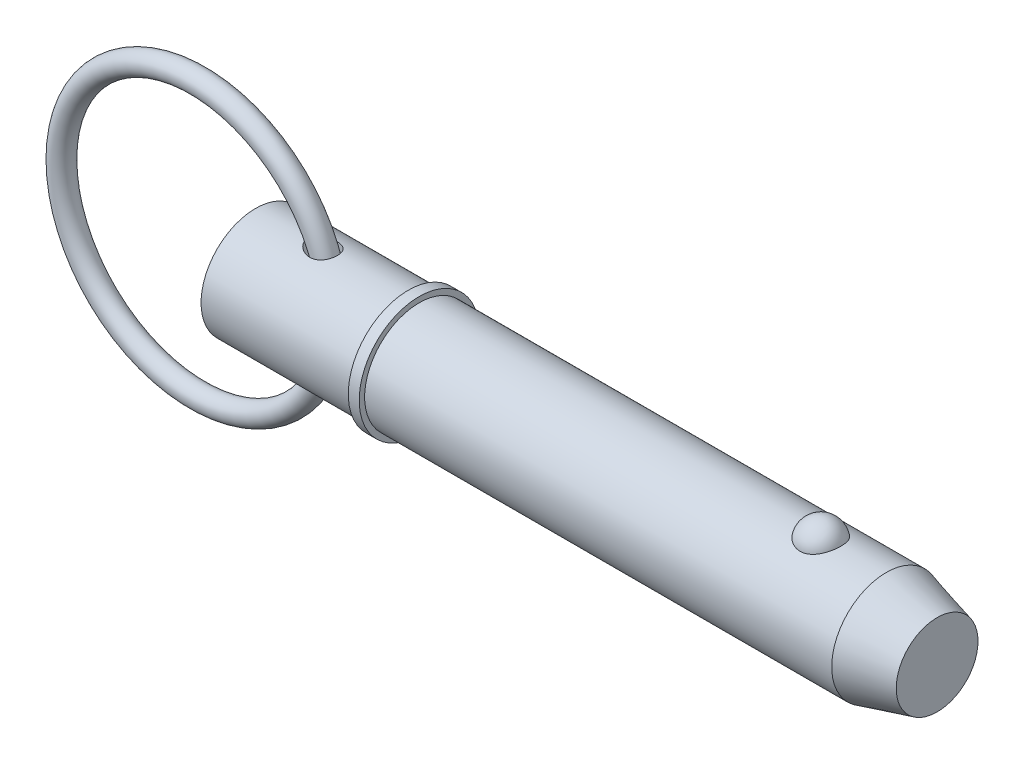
ISO-10303-21;
HEADER;
FILE_DESCRIPTION(('STEP AP214'),'2;1');
FILE_NAME('part.step','',(''),(''),'','','');
FILE_SCHEMA(('AUTOMOTIVE_DESIGN { 1 0 10303 214 1 1 1 1 }'));
ENDSEC;
DATA;
#1=APPLICATION_CONTEXT('core data for automotive mechanical design processes');
#2=APPLICATION_PROTOCOL_DEFINITION('international standard','automotive_design',2000,#1);
#3=PRODUCT_CONTEXT('',#1,'mechanical');
#4=PRODUCT('Part','Part','',(#3));
#5=PRODUCT_RELATED_PRODUCT_CATEGORY('part','',(#4));
#6=PRODUCT_DEFINITION_FORMATION('','',#4);
#7=PRODUCT_DEFINITION_CONTEXT('part definition',#1,'design');
#8=PRODUCT_DEFINITION('design','',#6,#7);
#9=PRODUCT_DEFINITION_SHAPE('','',#8);
#10=(LENGTH_UNIT() NAMED_UNIT(*) SI_UNIT(.MILLI.,.METRE.));
#11=(NAMED_UNIT(*) PLANE_ANGLE_UNIT() SI_UNIT($,.RADIAN.));
#12=(NAMED_UNIT(*) SI_UNIT($,.STERADIAN.) SOLID_ANGLE_UNIT());
#13=UNCERTAINTY_MEASURE_WITH_UNIT(LENGTH_MEASURE(1.E-05),#10,'distance_accuracy_value','');
#14=(GEOMETRIC_REPRESENTATION_CONTEXT(3) GLOBAL_UNCERTAINTY_ASSIGNED_CONTEXT((#13)) GLOBAL_UNIT_ASSIGNED_CONTEXT((#10,
#11,#12)) REPRESENTATION_CONTEXT('',''));
#15=CARTESIAN_POINT('',(0.,0.,0.));
#16=DIRECTION('',(0.,0.,1.));
#17=DIRECTION('',(1.,0.,0.));
#18=AXIS2_PLACEMENT_3D('',#15,#16,#17);
#19=CARTESIAN_POINT('',(-13.4840686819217,0.,0.));
#20=DIRECTION('',(0.,0.,1.));
#21=DIRECTION('',(1.,0.,0.));
#22=AXIS2_PLACEMENT_3D('',#19,#20,#21);
#23=TOROIDAL_SURFACE('',#22,31.75,2.54);
#24=CARTESIAN_POINT('',(20.8059313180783,0.,0.));
#25=VERTEX_POINT('',#24);
#26=VERTEX_LOOP('',#25);
#27=FACE_BOUND('',#26,.T.);
#28=ADVANCED_FACE('P0_F12',(#27),#23,.T.);
#29=CLOSED_SHELL('',(#28));
#30=MANIFOLD_SOLID_BREP('P0_B1',#29);
#31=CARTESIAN_POINT('',(0.,0.,0.));
#32=DIRECTION('',(1.,0.,0.));
#33=DIRECTION('',(0.,0.,-1.));
#34=AXIS2_PLACEMENT_3D('',#31,#32,#33);
#35=CYLINDRICAL_SURFACE('',#34,12.7);
#36=CARTESIAN_POINT('',(13.092900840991,12.5230976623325,-2.11234992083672));
#37=CARTESIAN_POINT('',(13.2535855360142,12.4976398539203,-2.26328363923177));
#38=CARTESIAN_POINT('',(13.4280602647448,12.4718592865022,-2.3995578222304));
#39=CARTESIAN_POINT('',(13.7976341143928,12.4229301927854,-2.64122157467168));
#40=CARTESIAN_POINT('',(13.9927568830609,12.3997847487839,-2.74657519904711));
#41=CARTESIAN_POINT('',(14.397672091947,12.3590534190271,-2.92439761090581));
#42=CARTESIAN_POINT('',(14.6074445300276,12.3414601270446,-2.99691026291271));
#43=CARTESIAN_POINT('',(15.0366557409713,12.3142893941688,-3.10669649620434));
#44=CARTESIAN_POINT('',(15.2560902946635,12.3047084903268,-3.14398530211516));
#45=CARTESIAN_POINT('',(15.5877843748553,12.2976819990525,-3.17128282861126));
#46=CARTESIAN_POINT('',(15.6989364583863,12.2965677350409,-3.17559470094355));
#47=CARTESIAN_POINT('',(15.9211629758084,12.2969101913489,-3.17427486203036));
#48=CARTESIAN_POINT('',(16.0322374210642,12.2983656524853,-3.16864802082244));
#49=CARTESIAN_POINT('',(16.2532861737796,12.3038832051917,-3.14715368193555));
#50=CARTESIAN_POINT('',(16.363260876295,12.3079443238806,-3.13129000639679));
#51=CARTESIAN_POINT('',(16.5810669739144,12.3185954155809,-3.08912320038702));
#52=CARTESIAN_POINT('',(16.6888986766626,12.3251850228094,-3.06282157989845));
#53=CARTESIAN_POINT('',(16.8894247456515,12.3398294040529,-3.00323791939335));
#54=CARTESIAN_POINT('',(16.9824664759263,12.3476389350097,-2.97106098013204));
#55=CARTESIAN_POINT('',(17.1651267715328,12.3648759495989,-2.89848824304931));
#56=CARTESIAN_POINT('',(17.2547457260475,12.3743032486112,-2.85809338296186));
#57=CARTESIAN_POINT('',(17.4297224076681,12.3944822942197,-2.76927391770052));
#58=CARTESIAN_POINT('',(17.5150817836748,12.40523352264,-2.72085245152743));
#59=CARTESIAN_POINT('',(17.6807665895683,12.4277046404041,-2.61629867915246));
#60=CARTESIAN_POINT('',(17.7610923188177,12.4394244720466,-2.56016683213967));
#61=CARTESIAN_POINT('',(17.9797287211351,12.4733252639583,-2.39133767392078));
#62=CARTESIAN_POINT('',(18.1114611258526,12.4961902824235,-2.27005507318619));
#63=CARTESIAN_POINT('',(18.3518677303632,12.5412050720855,-2.00648954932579));
#64=CARTESIAN_POINT('',(18.4605454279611,12.5633549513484,-1.86420981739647));
#65=CARTESIAN_POINT('',(18.6498843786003,12.6039384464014,-1.56614816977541));
#66=CARTESIAN_POINT('',(18.7311185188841,12.622444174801,-1.41073996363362));
#67=CARTESIAN_POINT('',(18.8669149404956,12.6543302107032,-1.08819514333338));
#68=CARTESIAN_POINT('',(18.921477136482,12.6677105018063,-0.921058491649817));
#69=CARTESIAN_POINT('',(19.0028875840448,12.6879542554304,-0.579029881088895));
#70=CARTESIAN_POINT('',(19.0296164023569,12.6947896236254,-0.404107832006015));
#71=CARTESIAN_POINT('',(19.0543673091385,12.7011128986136,-0.0521104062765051));
#72=CARTESIAN_POINT('',(19.0523885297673,12.7006005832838,0.124965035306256));
#73=CARTESIAN_POINT('',(19.019700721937,12.692266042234,0.476969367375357));
#74=CARTESIAN_POINT('',(18.9888798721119,12.6844153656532,0.651887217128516));
#75=CARTESIAN_POINT('',(18.8990221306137,12.6622099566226,0.99389064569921));
#76=CARTESIAN_POINT('',(18.839985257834,12.6478552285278,1.16097622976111));
#77=CARTESIAN_POINT('',(18.6951419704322,12.6142309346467,1.48231767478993));
#78=CARTESIAN_POINT('',(18.6093706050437,12.5949678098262,1.63659000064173));
#79=CARTESIAN_POINT('',(18.4131352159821,12.5536490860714,1.92810749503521));
#80=CARTESIAN_POINT('',(18.3026732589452,12.5315937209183,2.06535408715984));
#81=CARTESIAN_POINT('',(18.060669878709,12.4872833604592,2.31822774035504));
#82=CARTESIAN_POINT('',(17.9292520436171,12.4650302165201,2.43397343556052));
#83=CARTESIAN_POINT('',(17.6485957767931,12.4226514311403,2.64178289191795));
#84=CARTESIAN_POINT('',(17.4993587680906,12.4025256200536,2.73384854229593));
#85=CARTESIAN_POINT('',(17.1869531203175,12.3664726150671,2.8925825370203));
#86=CARTESIAN_POINT('',(17.0237450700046,12.3505578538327,2.95917592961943));
#87=CARTESIAN_POINT('',(16.6884731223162,12.3245177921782,3.06582547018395));
#88=CARTESIAN_POINT('',(16.516407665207,12.3143935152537,3.10587692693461));
#89=CARTESIAN_POINT('',(16.1604213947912,12.3003788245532,3.16093927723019));
#90=CARTESIAN_POINT('',(15.9763106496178,12.2967791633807,3.17478342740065));
#91=CARTESIAN_POINT('',(15.6080973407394,12.2966663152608,3.17521180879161));
#92=CARTESIAN_POINT('',(15.4239948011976,12.3001555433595,3.16178674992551));
#93=CARTESIAN_POINT('',(15.0417156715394,12.3141744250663,3.10676725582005));
#94=CARTESIAN_POINT('',(14.8439465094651,12.3253658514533,3.06251977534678));
#95=CARTESIAN_POINT('',(14.4574652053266,12.3538942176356,2.94531863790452));
#96=CARTESIAN_POINT('',(14.2687614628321,12.3712367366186,2.87233891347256));
#97=CARTESIAN_POINT('',(13.8856104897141,12.4121323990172,2.69045747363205));
#98=CARTESIAN_POINT('',(13.6926012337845,12.4361434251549,2.57861276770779));
#99=CARTESIAN_POINT('',(13.328588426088,12.4862632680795,2.32379935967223));
#100=CARTESIAN_POINT('',(13.1575718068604,12.5123708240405,2.18084927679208));
#101=CARTESIAN_POINT('',(12.8776146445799,12.5579467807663,1.89840233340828));
#102=CARTESIAN_POINT('',(12.7631663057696,12.5776642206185,1.76440341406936));
#103=CARTESIAN_POINT('',(12.5574911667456,12.6143643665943,1.47931295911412));
#104=CARTESIAN_POINT('',(12.4662309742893,12.6313509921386,1.32824646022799));
#105=CARTESIAN_POINT('',(12.3240650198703,12.6583901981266,1.03598403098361));
#106=CARTESIAN_POINT('',(12.2691183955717,12.6691064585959,0.896822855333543));
#107=CARTESIAN_POINT('',(12.1828741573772,12.6860954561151,0.611068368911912));
#108=CARTESIAN_POINT('',(12.1515620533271,12.6923709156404,0.464479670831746));
#109=CARTESIAN_POINT('',(12.1147168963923,12.6997676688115,0.167420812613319));
#110=CARTESIAN_POINT('',(12.1092708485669,12.7008715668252,0.0169392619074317));
#111=CARTESIAN_POINT('',(12.1248234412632,12.6977391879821,-0.282592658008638));
#112=CARTESIAN_POINT('',(12.1458245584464,12.6935024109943,-0.431642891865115));
#113=CARTESIAN_POINT('',(12.210908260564,12.6805581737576,-0.716008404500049));
#114=CARTESIAN_POINT('',(12.2537133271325,12.6720986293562,-0.851633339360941));
#115=CARTESIAN_POINT('',(12.3591295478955,12.6516826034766,-1.11460776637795));
#116=CARTESIAN_POINT('',(12.4217455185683,12.6397252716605,-1.24195523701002));
#117=CARTESIAN_POINT('',(12.5735635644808,12.61152213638,-1.50300095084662));
#118=CARTESIAN_POINT('',(12.6652159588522,12.5949150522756,-1.63522875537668));
#119=CARTESIAN_POINT('',(12.8664347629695,12.5599626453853,-1.88501670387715));
#120=CARTESIAN_POINT('',(12.9760196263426,12.541615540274,-2.0025615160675));
#121=CARTESIAN_POINT('',(13.092900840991,12.5230976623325,-2.11234992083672));
#122=B_SPLINE_CURVE_WITH_KNOTS('',3,(#36,#37,#38,#39,#40,#41,#42,#43,#44,#45,#46,#47,#48,#49,
#50,#51,#52,#53,#54,#55,#56,#57,#58,#59,#60,#61,#62,#63,#64,#65,#66,#67,#68,#69,#70,#71,#72,#73,
#74,#75,#76,#77,#78,#79,#80,#81,#82,#83,#84,#85,#86,#87,#88,#89,#90,#91,#92,#93,#94,#95,#96,#97,
#98,#99,#100,#101,#102,#103,#104,#105,#106,#107,#108,#109,#110,#111,#112,#113,#114,#115,#116,
#117,#118,#119,#120,#121),.UNSPECIFIED.,.T.,.F.,(4,2,2,2,2,2,2,2,2,2,2,2,2,2,2,2,2,2,2,2,2,2,2,
2,2,2,2,2,2,2,2,2,2,2,2,2,2,2,2,2,2,2,4),(0.,0.665132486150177,1.33103515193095,
1.99604575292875,2.66076878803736,2.99410229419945,3.32727250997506,3.66031840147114,
3.99331613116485,4.28918991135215,4.58502994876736,4.88075456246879,5.17646157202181,
5.71510826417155,6.2536731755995,6.78017774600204,7.30668400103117,7.83544030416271,
8.36421259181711,8.89504347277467,9.42587399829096,9.95601150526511,10.4861046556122,
11.0131799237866,11.5402131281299,12.0687854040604,12.5974510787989,13.1491450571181,
13.7010270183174,14.3074556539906,14.914435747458,15.5844380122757,16.2540403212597,
16.7839879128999,17.3131679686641,17.7612578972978,18.2090728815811,18.658393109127,
19.1077554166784,19.5333866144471,19.959121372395,20.4424347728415,20.9262486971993),.UNSPECIFIED.);
#123=CARTESIAN_POINT('',(13.092900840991,12.5230976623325,-2.11234992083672));
#124=VERTEX_POINT('',#123);
#125=EDGE_CURVE('P1_E42',#124,#124,#122,.T.);
#126=ORIENTED_EDGE('',*,*,#125,.T.);
#127=EDGE_LOOP('',(#126));
#128=FACE_BOUND('',#127,.T.);
#129=CARTESIAN_POINT('',(0.,0.,0.));
#130=DIRECTION('',(1.,0.,0.));
#131=DIRECTION('',(0.,0.,-1.));
#132=AXIS2_PLACEMENT_3D('',#129,#130,#131);
#133=CIRCLE('',#132,12.7);
#134=CARTESIAN_POINT('',(0.,0.,-12.7));
#135=VERTEX_POINT('',#134);
#136=EDGE_CURVE('P1_E9',#135,#135,#133,.T.);
#137=ORIENTED_EDGE('',*,*,#136,.T.);
#138=EDGE_LOOP('',(#137));
#139=FACE_BOUND('',#138,.T.);
#140=CARTESIAN_POINT('',(35.56,0.,0.));
#141=DIRECTION('',(1.,0.,0.));
#142=DIRECTION('',(0.,0.,-1.));
#143=AXIS2_PLACEMENT_3D('',#140,#141,#142);
#144=CIRCLE('',#143,12.7);
#145=CARTESIAN_POINT('',(35.56,0.,-12.7));
#146=VERTEX_POINT('',#145);
#147=EDGE_CURVE('P1_E25',#146,#146,#144,.T.);
#148=ORIENTED_EDGE('',*,*,#147,.F.);
#149=EDGE_LOOP('',(#148));
#150=FACE_BOUND('',#149,.T.);
#151=CARTESIAN_POINT('',(13.092900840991,-12.5230976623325,-2.11234992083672));
#152=CARTESIAN_POINT('',(12.9659872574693,-12.5432050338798,-1.99314161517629));
#153=CARTESIAN_POINT('',(12.847667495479,-12.5631124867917,-1.86478966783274));
#154=CARTESIAN_POINT('',(12.6324721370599,-12.6007427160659,-1.59069749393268));
#155=CARTESIAN_POINT('',(12.5355833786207,-12.6184668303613,-1.444968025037));
#156=CARTESIAN_POINT('',(12.409907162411,-12.642034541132,-1.21450950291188));
#157=CARTESIAN_POINT('',(12.3711427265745,-12.6494175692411,-1.13527163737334));
#158=CARTESIAN_POINT('',(12.3010994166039,-12.6628962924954,-0.973464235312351));
#159=CARTESIAN_POINT('',(12.2698164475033,-12.6689926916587,-0.890896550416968));
#160=CARTESIAN_POINT('',(12.2153933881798,-12.6796767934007,-0.723090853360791));
#161=CARTESIAN_POINT('',(12.192246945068,-12.6842656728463,-0.637854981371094));
#162=CARTESIAN_POINT('',(12.154603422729,-12.6917620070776,-0.465421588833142));
#163=CARTESIAN_POINT('',(12.1401047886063,-12.69466976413,-0.378224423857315));
#164=CARTESIAN_POINT('',(12.1214471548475,-12.6984180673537,-0.214417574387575));
#165=CARTESIAN_POINT('',(12.1161713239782,-12.699481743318,-0.137938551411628));
#166=CARTESIAN_POINT('',(12.1124989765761,-12.7002217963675,0.0152189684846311));
#167=CARTESIAN_POINT('',(12.1141046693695,-12.6998977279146,0.0918975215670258));
#168=CARTESIAN_POINT('',(12.1241695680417,-12.6978712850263,0.24474645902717));
#169=CARTESIAN_POINT('',(12.132625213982,-12.6961696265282,0.320917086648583));
#170=CARTESIAN_POINT('',(12.1562110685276,-12.6914452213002,0.472185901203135));
#171=CARTESIAN_POINT('',(12.1713438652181,-12.6884219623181,0.547283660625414));
#172=CARTESIAN_POINT('',(12.223731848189,-12.6780227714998,0.759415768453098));
#173=CARTESIAN_POINT('',(12.268839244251,-12.6691353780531,0.894507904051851));
#174=CARTESIAN_POINT('',(12.3786059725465,-12.6479567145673,1.1560647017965));
#175=CARTESIAN_POINT('',(12.4432700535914,-12.6356646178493,1.28252725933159));
#176=CARTESIAN_POINT('',(12.5971341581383,-12.607236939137,1.5381272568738));
#177=CARTESIAN_POINT('',(12.6882234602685,-12.5908303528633,1.66609325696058));
#178=CARTESIAN_POINT('',(12.887209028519,-12.5564642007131,1.90792082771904));
#179=CARTESIAN_POINT('',(12.995115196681,-12.5385037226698,2.02177401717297));
#180=CARTESIAN_POINT('',(13.2471335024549,-12.4987806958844,2.25547266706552));
#181=CARTESIAN_POINT('',(13.3941979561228,-12.4769622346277,2.3721269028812));
#182=CARTESIAN_POINT('',(13.7036983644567,-12.4349587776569,2.58329351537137));
#183=CARTESIAN_POINT('',(13.8661464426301,-12.4147750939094,2.67778822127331));
#184=CARTESIAN_POINT('',(14.2306024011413,-12.3748157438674,2.85722657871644));
#185=CARTESIAN_POINT('',(14.4347220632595,-12.3556533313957,2.93804226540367));
#186=CARTESIAN_POINT('',(14.8540416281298,-12.3245430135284,3.06594877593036));
#187=CARTESIAN_POINT('',(15.0692453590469,-12.3125976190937,3.11302786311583));
#188=CARTESIAN_POINT('',(15.3981213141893,-12.3014943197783,3.15648626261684));
#189=CARTESIAN_POINT('',(15.5100235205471,-12.298940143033,3.16639841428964));
#190=CARTESIAN_POINT('',(15.7342812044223,-12.2963942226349,3.17627668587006));
#191=CARTESIAN_POINT('',(15.8466364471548,-12.2964012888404,3.1762474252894));
#192=CARTESIAN_POINT('',(16.0707903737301,-12.2990694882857,3.16589868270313));
#193=CARTESIAN_POINT('',(16.1825892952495,-12.3017293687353,3.1555840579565));
#194=CARTESIAN_POINT('',(16.4046123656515,-12.3096862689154,3.12440163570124));
#195=CARTESIAN_POINT('',(16.514836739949,-12.314982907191,3.10353536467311));
#196=CARTESIAN_POINT('',(16.7211934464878,-12.3273933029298,3.05384263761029));
#197=CARTESIAN_POINT('',(16.8175961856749,-12.3342598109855,3.0260738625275));
#198=CARTESIAN_POINT('',(17.0073515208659,-12.3498131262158,2.96195947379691));
#199=CARTESIAN_POINT('',(17.100704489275,-12.3584997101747,2.92561491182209));
#200=CARTESIAN_POINT('',(17.2834584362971,-12.3774243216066,2.84448580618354));
#201=CARTESIAN_POINT('',(17.3728610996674,-12.3876616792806,2.79970490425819));
#202=CARTESIAN_POINT('',(17.5469061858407,-12.409352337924,2.701939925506));
#203=CARTESIAN_POINT('',(17.6315489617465,-12.4208055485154,2.64895645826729));
#204=CARTESIAN_POINT('',(17.7872886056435,-12.4433734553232,2.54070972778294));
#205=CARTESIAN_POINT('',(17.8589017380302,-12.4544123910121,2.48617167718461));
#206=CARTESIAN_POINT('',(17.9970802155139,-12.4768404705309,2.37105291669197));
#207=CARTESIAN_POINT('',(18.063643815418,-12.4882297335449,2.31047013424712));
#208=CARTESIAN_POINT('',(18.1911677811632,-12.5110137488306,2.18372894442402));
#209=CARTESIAN_POINT('',(18.2521311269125,-12.5224084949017,2.11757353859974));
#210=CARTESIAN_POINT('',(18.3680676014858,-12.5448751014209,1.98014449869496));
#211=CARTESIAN_POINT('',(18.4230385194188,-12.5559468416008,1.90886899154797));
#212=CARTESIAN_POINT('',(18.5752306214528,-12.5875288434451,1.69257698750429));
#213=CARTESIAN_POINT('',(18.6637018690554,-12.6071482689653,1.54111740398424));
#214=CARTESIAN_POINT('',(18.8143485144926,-12.6417556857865,1.225260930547));
#215=CARTESIAN_POINT('',(18.876524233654,-12.6567437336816,1.06086419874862));
#216=CARTESIAN_POINT('',(18.9733884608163,-12.6805238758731,0.723195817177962));
#217=CARTESIAN_POINT('',(19.0079967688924,-12.6892978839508,0.549899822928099));
#218=CARTESIAN_POINT('',(19.0486500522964,-12.6996362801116,0.199781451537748));
#219=CARTESIAN_POINT('',(19.054694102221,-12.7012004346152,0.0229589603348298));
#220=CARTESIAN_POINT('',(19.0380549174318,-12.6969431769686,-0.330044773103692));
#221=CARTESIAN_POINT('',(19.0152419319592,-12.6910884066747,-0.506219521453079));
#222=CARTESIAN_POINT('',(18.9411599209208,-12.672565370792,-0.852112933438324));
#223=CARTESIAN_POINT('',(18.8898907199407,-12.659897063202,-1.0218315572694));
#224=CARTESIAN_POINT('',(18.7600888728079,-12.6291327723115,-1.34987035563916));
#225=CARTESIAN_POINT('',(18.6815715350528,-12.6110398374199,-1.50819687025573));
#226=CARTESIAN_POINT('',(18.4991526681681,-12.5714188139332,-1.808997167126));
#227=CARTESIAN_POINT('',(18.3952529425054,-12.5498909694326,-1.95147207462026));
#228=CARTESIAN_POINT('',(18.1653806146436,-12.5059234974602,-2.21580059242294));
#229=CARTESIAN_POINT('',(18.0395297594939,-12.4834893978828,-2.33776101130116));
#230=CARTESIAN_POINT('',(17.7688701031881,-12.4400863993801,-2.55870399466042));
#231=CARTESIAN_POINT('',(17.6240631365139,-12.4191173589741,-2.65768878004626));
#232=CARTESIAN_POINT('',(17.3196803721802,-12.380896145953,-2.8304192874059));
#233=CARTESIAN_POINT('',(17.1601036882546,-12.3636441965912,-2.90416349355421));
#234=CARTESIAN_POINT('',(16.8308162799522,-12.3345597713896,-3.02531546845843));
#235=CARTESIAN_POINT('',(16.6611041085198,-12.322728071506,-3.07271946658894));
#236=CARTESIAN_POINT('',(16.3099674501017,-12.3051318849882,-3.14246490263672));
#237=CARTESIAN_POINT('',(16.1283412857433,-12.2996014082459,-3.16384159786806));
#238=CARTESIAN_POINT('',(15.7639014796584,-12.2955807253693,-3.17942379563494));
#239=CARTESIAN_POINT('',(15.5810875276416,-12.2970924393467,-3.17362188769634));
#240=CARTESIAN_POINT('',(15.20154276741,-12.307074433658,-3.13470416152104));
#241=CARTESIAN_POINT('',(15.0050835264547,-12.316173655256,-3.09911848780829));
#242=CARTESIAN_POINT('',(14.6197996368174,-12.3407987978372,-2.99954607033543));
#243=CARTESIAN_POINT('',(14.4309834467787,-12.3563316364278,-2.93552875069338));
#244=CARTESIAN_POINT('',(14.0353751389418,-12.3949378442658,-2.76840280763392));
#245=CARTESIAN_POINT('',(13.8306109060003,-12.4188242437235,-2.66064798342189));
#246=CARTESIAN_POINT('',(13.4432099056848,-12.4696241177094,-2.4113475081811));
#247=CARTESIAN_POINT('',(13.2605568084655,-12.4965353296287,-2.26982702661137));
#248=CARTESIAN_POINT('',(13.092900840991,-12.5230976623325,-2.11234992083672));
#249=B_SPLINE_CURVE_WITH_KNOTS('',3,(#151,#152,#153,#154,#155,#156,#157,#158,#159,#160,#161,
#162,#163,#164,#165,#166,#167,#168,#169,#170,#171,#172,#173,#174,#175,#176,#177,#178,#179,#180,
#181,#182,#183,#184,#185,#186,#187,#188,#189,#190,#191,#192,#193,#194,#195,#196,#197,#198,#199,
#200,#201,#202,#203,#204,#205,#206,#207,#208,#209,#210,#211,#212,#213,#214,#215,#216,#217,#218,
#219,#220,#221,#222,#223,#224,#225,#226,#227,#228,#229,#230,#231,#232,#233,#234,#235,#236,#237,
#238,#239,#240,#241,#242,#243,#244,#245,#246,#247,#248),.UNSPECIFIED.,.T.,.F.,(4,2,2,2,2,2,2,2,
2,2,2,2,2,2,2,2,2,2,2,2,2,2,2,2,2,2,2,2,2,2,2,2,2,2,2,2,2,2,2,2,2,2,2,2,2,2,2,2,4),(0.,
0.525289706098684,1.05025590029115,1.31549608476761,1.58059075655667,1.84547798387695,
2.11031756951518,2.34000998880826,2.56977615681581,2.79942299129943,3.0291589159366,
3.45531787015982,3.8815803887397,4.35362362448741,4.82594586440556,5.39074449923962,
5.95599200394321,6.61421946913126,7.27267581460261,7.60939383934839,7.9459554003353,
8.2823580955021,8.61871213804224,8.91997243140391,9.22119579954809,9.52228943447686,
9.82336070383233,10.0950952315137,10.3669232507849,10.6386057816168,10.9103882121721,
11.4371688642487,11.9639430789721,12.4922442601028,13.0205625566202,13.5512648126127,
14.0819703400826,14.6123781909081,15.1427483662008,15.6702654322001,16.1977314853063,
16.7252292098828,17.2528024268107,17.7993878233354,18.3461222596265,18.9432829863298,
19.541087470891,20.2355241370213,20.9294447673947),.UNSPECIFIED.);
#250=CARTESIAN_POINT('',(13.092900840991,-12.5230976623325,-2.11234992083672));
#251=VERTEX_POINT('',#250);
#252=EDGE_CURVE('P1_E17',#251,#251,#249,.T.);
#253=ORIENTED_EDGE('',*,*,#252,.T.);
#254=EDGE_LOOP('',(#253));
#255=FACE_BOUND('',#254,.T.);
#256=ADVANCED_FACE('P1_F13',(#128,#139,#150,#255),#35,.T.);
#257=CARTESIAN_POINT('',(0.,0.,0.));
#258=DIRECTION('',(1.,0.,0.));
#259=DIRECTION('',(0.,0.,-1.));
#260=AXIS2_PLACEMENT_3D('',#257,#258,#259);
#261=CYLINDRICAL_SURFACE('',#260,12.7);
#262=CARTESIAN_POINT('',(146.900738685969,0.,0.));
#263=DIRECTION('',(1.,0.,0.));
#264=DIRECTION('',(0.,0.,-1.));
#265=AXIS2_PLACEMENT_3D('',#262,#263,#264);
#266=CIRCLE('',#265,12.7);
#267=CARTESIAN_POINT('',(146.900738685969,0.,-12.7));
#268=VERTEX_POINT('',#267);
#269=EDGE_CURVE('P1_E99',#268,#268,#266,.T.);
#270=ORIENTED_EDGE('',*,*,#269,.F.);
#271=EDGE_LOOP('',(#270));
#272=FACE_BOUND('',#271,.T.);
#273=CARTESIAN_POINT('',(38.1,0.,0.));
#274=DIRECTION('',(1.,0.,0.));
#275=DIRECTION('',(0.,0.,-1.));
#276=AXIS2_PLACEMENT_3D('',#273,#274,#275);
#277=CIRCLE('',#276,12.7);
#278=CARTESIAN_POINT('',(38.1,0.,-12.7));
#279=VERTEX_POINT('',#278);
#280=EDGE_CURVE('P1_E96',#279,#279,#277,.T.);
#281=ORIENTED_EDGE('',*,*,#280,.T.);
#282=EDGE_LOOP('',(#281));
#283=FACE_BOUND('',#282,.T.);
#284=CARTESIAN_POINT('',(131.660042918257,11.7500437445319,4.81938502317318));
#285=CARTESIAN_POINT('',(131.535088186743,11.7500430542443,4.81938571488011));
#286=CARTESIAN_POINT('',(131.410144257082,11.7520975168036,4.81438658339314));
#287=CARTESIAN_POINT('',(131.161142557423,11.760253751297,4.79442904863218));
#288=CARTESIAN_POINT('',(131.037085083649,11.7663568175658,4.77946746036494));
#289=CARTESIAN_POINT('',(130.790901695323,11.7824262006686,4.7397141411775));
#290=CARTESIAN_POINT('',(130.668774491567,11.7923898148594,4.71492928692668));
#291=CARTESIAN_POINT('',(130.427187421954,11.8158938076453,4.65571340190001));
#292=CARTESIAN_POINT('',(130.30772859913,11.8294355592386,4.6212786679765));
#293=CARTESIAN_POINT('',(130.072557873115,11.8596812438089,4.54309502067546));
#294=CARTESIAN_POINT('',(129.956839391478,11.8763792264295,4.49936361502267));
#295=CARTESIAN_POINT('',(129.729653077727,11.9124878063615,4.40287235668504));
#296=CARTESIAN_POINT('',(129.618186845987,11.9318994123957,4.35010914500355));
#297=CARTESIAN_POINT('',(129.291278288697,11.9934256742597,4.17881316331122));
#298=CARTESIAN_POINT('',(129.083127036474,12.038858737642,4.04720756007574));
#299=CARTESIAN_POINT('',(128.685850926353,12.1352173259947,3.748564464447));
#300=CARTESIAN_POINT('',(128.497443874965,12.1862630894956,3.58061821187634));
#301=CARTESIAN_POINT('',(128.150521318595,12.2875163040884,3.21600758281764));
#302=CARTESIAN_POINT('',(127.992011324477,12.3377235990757,3.0193379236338));
#303=CARTESIAN_POINT('',(127.70168878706,12.4344923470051,2.592916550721));
#304=CARTESIAN_POINT('',(127.571376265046,12.4807925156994,2.36208286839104));
#305=CARTESIAN_POINT('',(127.349407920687,12.5623454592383,1.88070399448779));
#306=CARTESIAN_POINT('',(127.257755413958,12.5975972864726,1.63015711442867));
#307=CARTESIAN_POINT('',(127.114046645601,12.6538414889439,1.1129886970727));
#308=CARTESIAN_POINT('',(127.062499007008,12.6746503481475,0.846205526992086));
#309=CARTESIAN_POINT('',(127.001977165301,12.699153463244,0.307085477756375));
#310=CARTESIAN_POINT('',(126.993001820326,12.7028481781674,0.034748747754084));
#311=CARTESIAN_POINT('',(127.017731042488,12.6927785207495,-0.506073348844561));
#312=CARTESIAN_POINT('',(127.051189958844,12.6791146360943,-0.774571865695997));
#313=CARTESIAN_POINT('',(127.159687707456,12.635882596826,-1.30170246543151));
#314=CARTESIAN_POINT('',(127.23472729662,12.606314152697,-1.56033436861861));
#315=CARTESIAN_POINT('',(127.425000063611,12.5342328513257,-2.0608389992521));
#316=CARTESIAN_POINT('',(127.540287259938,12.4917026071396,-2.30268867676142));
#317=CARTESIAN_POINT('',(127.808704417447,12.3981123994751,-2.76259600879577));
#318=CARTESIAN_POINT('',(127.961837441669,12.3470517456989,-2.98065173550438));
#319=CARTESIAN_POINT('',(128.303507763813,12.2416045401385,-3.38786328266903));
#320=CARTESIAN_POINT('',(128.492201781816,12.1872040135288,-3.57688418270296));
#321=CARTESIAN_POINT('',(128.900239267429,12.0814086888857,-3.91941073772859));
#322=CARTESIAN_POINT('',(129.119580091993,12.0300136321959,-4.07291945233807));
#323=CARTESIAN_POINT('',(129.578375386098,11.9373542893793,-4.33691289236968));
#324=CARTESIAN_POINT('',(129.817304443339,11.8958982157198,-4.44824125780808));
#325=CARTESIAN_POINT('',(130.31243761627,11.8268116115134,-4.62881985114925));
#326=CARTESIAN_POINT('',(130.568635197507,11.7991758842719,-4.69808589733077));
#327=CARTESIAN_POINT('',(131.077164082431,11.7622209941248,-4.78983181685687));
#328=CARTESIAN_POINT('',(131.329041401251,11.7520502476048,-4.81449025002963));
#329=CARTESIAN_POINT('',(131.833573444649,11.7485796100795,-4.82295735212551));
#330=CARTESIAN_POINT('',(132.086228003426,11.7552763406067,-4.80677420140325));
#331=CARTESIAN_POINT('',(132.576834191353,11.7842584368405,-4.73525430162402));
#332=CARTESIAN_POINT('',(132.814998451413,11.8060486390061,-4.68116061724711));
#333=CARTESIAN_POINT('',(133.278489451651,11.8622750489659,-4.53678133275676));
#334=CARTESIAN_POINT('',(133.503815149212,11.8967122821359,-4.44649279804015));
#335=CARTESIAN_POINT('',(133.940801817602,11.9754603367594,-4.2298761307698));
#336=CARTESIAN_POINT('',(134.152057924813,12.0199699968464,-4.10280539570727));
#337=CARTESIAN_POINT('',(134.550601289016,12.1138028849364,-3.81685409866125));
#338=CARTESIAN_POINT('',(134.737883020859,12.163127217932,-3.65796622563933));
#339=CARTESIAN_POINT('',(135.093350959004,12.2642343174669,-3.30364864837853));
#340=CARTESIAN_POINT('',(135.260111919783,12.3160165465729,-3.10678783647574));
#341=CARTESIAN_POINT('',(135.559579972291,12.4142566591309,-2.68748409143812));
#342=CARTESIAN_POINT('',(135.692280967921,12.4607135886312,-2.4650365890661));
#343=CARTESIAN_POINT('',(135.924691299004,12.5450236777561,-1.9928951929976));
#344=CARTESIAN_POINT('',(136.023215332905,12.5825557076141,-1.74255918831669));
#345=CARTESIAN_POINT('',(136.179227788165,12.6431720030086,-1.22773734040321));
#346=CARTESIAN_POINT('',(136.236715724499,12.6662560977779,-0.963251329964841));
#347=CARTESIAN_POINT('',(136.309544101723,12.6956486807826,-0.4273550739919));
#348=CARTESIAN_POINT('',(136.324837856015,12.7019385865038,-0.155937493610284));
#349=CARTESIAN_POINT('',(136.312779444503,12.6970201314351,0.38592890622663));
#350=CARTESIAN_POINT('',(136.28542805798,12.6858120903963,0.65637774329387));
#351=CARTESIAN_POINT('',(136.213060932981,12.6568455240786,1.05454017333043));
#352=CARTESIAN_POINT('',(136.183796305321,12.6451962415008,1.18577850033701));
#353=CARTESIAN_POINT('',(136.115022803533,12.6181819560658,1.44513808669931));
#354=CARTESIAN_POINT('',(136.075517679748,12.6028183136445,1.57326046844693));
#355=CARTESIAN_POINT('',(135.986439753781,12.5687547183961,1.82554978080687));
#356=CARTESIAN_POINT('',(135.936862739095,12.5500533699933,1.94971503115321));
#357=CARTESIAN_POINT('',(135.82792115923,12.5098093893,2.19314370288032));
#358=CARTESIAN_POINT('',(135.768560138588,12.4882677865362,2.31240887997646));
#359=CARTESIAN_POINT('',(135.63997128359,12.4427679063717,2.5459303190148));
#360=CARTESIAN_POINT('',(135.570688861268,12.4187964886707,2.66015396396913));
#361=CARTESIAN_POINT('',(135.422903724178,12.3691892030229,2.88202659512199));
#362=CARTESIAN_POINT('',(135.344404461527,12.3435539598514,2.98967802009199));
#363=CARTESIAN_POINT('',(135.178550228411,12.2912955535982,3.1977438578));
#364=CARTESIAN_POINT('',(135.091191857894,12.2646720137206,3.29815546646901));
#365=CARTESIAN_POINT('',(134.908161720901,12.2111945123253,3.49095035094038));
#366=CARTESIAN_POINT('',(134.812493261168,12.1843406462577,3.58333679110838));
#367=CARTESIAN_POINT('',(134.613627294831,12.1312249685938,3.75922876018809));
#368=CARTESIAN_POINT('',(134.510450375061,12.104961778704,3.84275713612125));
#369=CARTESIAN_POINT('',(134.29701336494,12.0537284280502,4.00056406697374));
#370=CARTESIAN_POINT('',(134.186756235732,12.028757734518,4.07484645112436));
#371=CARTESIAN_POINT('',(133.959755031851,11.9808306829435,4.21367959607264));
#372=CARTESIAN_POINT('',(133.843006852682,11.9578756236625,4.27822410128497));
#373=CARTESIAN_POINT('',(133.60394258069,11.9147184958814,4.39698483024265));
#374=CARTESIAN_POINT('',(133.481628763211,11.894515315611,4.45120522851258));
#375=CARTESIAN_POINT('',(133.222952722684,11.8561129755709,4.55255353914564));
#376=CARTESIAN_POINT('',(133.086223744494,11.8381764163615,4.59884858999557));
#377=CARTESIAN_POINT('',(132.808608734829,11.8069093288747,4.67853897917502));
#378=CARTESIAN_POINT('',(132.667724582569,11.7935767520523,4.71194005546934));
#379=CARTESIAN_POINT('',(132.38309446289,11.7720277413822,4.76552188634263));
#380=CARTESIAN_POINT('',(132.239348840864,11.7638106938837,4.78570422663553));
#381=CARTESIAN_POINT('',(131.950411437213,11.7528195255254,4.81263433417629));
#382=CARTESIAN_POINT('',(131.805219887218,11.7500445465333,4.81938421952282));
#383=CARTESIAN_POINT('',(131.660042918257,11.7500437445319,4.81938502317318));
#384=B_SPLINE_CURVE_WITH_KNOTS('',3,(#284,#285,#286,#287,#288,#289,#290,#291,#292,#293,#294,
#295,#296,#297,#298,#299,#300,#301,#302,#303,#304,#305,#306,#307,#308,#309,#310,#311,#312,#313,
#314,#315,#316,#317,#318,#319,#320,#321,#322,#323,#324,#325,#326,#327,#328,#329,#330,#331,#332,
#333,#334,#335,#336,#337,#338,#339,#340,#341,#342,#343,#344,#345,#346,#347,#348,#349,#350,#351,
#352,#353,#354,#355,#356,#357,#358,#359,#360,#361,#362,#363,#364,#365,#366,#367,#368,#369,#370,
#371,#372,#373,#374,#375,#376,#377,#378,#379,#380,#381,#382,#383),.UNSPECIFIED.,.T.,.F.,(4,2,2,
2,2,2,2,2,2,2,2,2,2,2,2,2,2,2,2,2,2,2,2,2,2,2,2,2,2,2,2,2,2,2,2,2,2,2,2,2,2,2,2,2,2,2,2,2,2,4),
(0.,0.374729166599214,0.749578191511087,1.12416526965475,1.49889629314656,1.87292776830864,
2.24709865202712,2.99481328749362,3.76399449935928,4.53331735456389,5.3368391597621,
6.14042986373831,6.95405296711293,7.76765424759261,8.57656703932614,9.38549455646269,
10.1955119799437,11.0055949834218,11.8193353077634,12.6330054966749,13.4294141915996,
14.2255231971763,14.9815786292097,15.7374826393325,16.4696948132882,17.2019663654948,
17.9501979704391,18.6986017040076,19.4844704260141,20.2704797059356,21.0815215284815,
21.8925729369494,22.7045213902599,23.5164550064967,23.9209608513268,24.3253187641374,
24.7298461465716,25.1342272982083,25.54092555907,25.9474719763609,26.3541750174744,
26.7607169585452,27.1661834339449,27.5714814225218,27.9770386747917,28.3824315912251,
28.818120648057,29.2536155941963,29.6890582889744,30.1244323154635),.UNSPECIFIED.);
#385=CARTESIAN_POINT('',(131.660042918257,11.7500437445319,4.81938502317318));
#386=VERTEX_POINT('',#385);
#387=EDGE_CURVE('P1_E34',#386,#386,#384,.T.);
#388=ORIENTED_EDGE('',*,*,#387,.T.);
#389=EDGE_LOOP('',(#388));
#390=FACE_BOUND('',#389,.T.);
#391=ADVANCED_FACE('P1_F46',(#272,#283,#390),#261,.T.);
#392=CARTESIAN_POINT('',(0.,0.,0.));
#393=DIRECTION('',(-1.,0.,0.));
#394=DIRECTION('',(0.,0.,1.));
#395=AXIS2_PLACEMENT_3D('',#392,#393,#394);
#396=PLANE('',#395);
#397=ORIENTED_EDGE('',*,*,#136,.F.);
#398=EDGE_LOOP('',(#397));
#399=FACE_BOUND('',#398,.T.);
#400=ADVANCED_FACE('P1_F15',(#399),#396,.T.);
#401=CARTESIAN_POINT('',(35.56,12.7,0.));
#402=DIRECTION('',(-1.,0.,0.));
#403=DIRECTION('',(0.,0.,1.));
#404=AXIS2_PLACEMENT_3D('',#401,#402,#403);
#405=PLANE('',#404);
#406=ORIENTED_EDGE('',*,*,#147,.T.);
#407=EDGE_LOOP('',(#406));
#408=FACE_BOUND('',#407,.T.);
#409=CARTESIAN_POINT('',(35.56,0.,0.));
#410=DIRECTION('',(1.,0.,0.));
#411=DIRECTION('',(0.,0.,-1.));
#412=AXIS2_PLACEMENT_3D('',#409,#410,#411);
#413=CIRCLE('',#412,13.97);
#414=CARTESIAN_POINT('',(35.56,0.,-13.97));
#415=VERTEX_POINT('',#414);
#416=EDGE_CURVE('P1_E30',#415,#415,#413,.T.);
#417=ORIENTED_EDGE('',*,*,#416,.F.);
#418=EDGE_LOOP('',(#417));
#419=FACE_BOUND('',#418,.T.);
#420=ADVANCED_FACE('P1_F81',(#408,#419),#405,.T.);
#421=CARTESIAN_POINT('',(0.,0.,0.));
#422=DIRECTION('',(1.,0.,0.));
#423=DIRECTION('',(0.,0.,-1.));
#424=AXIS2_PLACEMENT_3D('',#421,#422,#423);
#425=CYLINDRICAL_SURFACE('',#424,13.97);
#426=ORIENTED_EDGE('',*,*,#416,.T.);
#427=EDGE_LOOP('',(#426));
#428=FACE_BOUND('',#427,.T.);
#429=CARTESIAN_POINT('',(38.1,0.,0.));
#430=DIRECTION('',(1.,0.,0.));
#431=DIRECTION('',(0.,0.,-1.));
#432=AXIS2_PLACEMENT_3D('',#429,#430,#431);
#433=CIRCLE('',#432,13.97);
#434=CARTESIAN_POINT('',(38.1,0.,-13.97));
#435=VERTEX_POINT('',#434);
#436=EDGE_CURVE('P1_E95',#435,#435,#433,.T.);
#437=ORIENTED_EDGE('',*,*,#436,.F.);
#438=EDGE_LOOP('',(#437));
#439=FACE_BOUND('',#438,.T.);
#440=ADVANCED_FACE('P1_F68',(#428,#439),#425,.T.);
#441=CARTESIAN_POINT('',(38.1,13.97,0.));
#442=DIRECTION('',(1.,0.,0.));
#443=DIRECTION('',(0.,0.,-1.));
#444=AXIS2_PLACEMENT_3D('',#441,#442,#443);
#445=PLANE('',#444);
#446=ORIENTED_EDGE('',*,*,#436,.T.);
#447=EDGE_LOOP('',(#446));
#448=FACE_BOUND('',#447,.T.);
#449=ORIENTED_EDGE('',*,*,#280,.F.);
#450=EDGE_LOOP('',(#449));
#451=FACE_BOUND('',#450,.T.);
#452=ADVANCED_FACE('P1_F62',(#448,#451),#445,.T.);
#453=CARTESIAN_POINT('',(158.75,0.,0.));
#454=DIRECTION('',(-1.,0.,0.));
#455=DIRECTION('',(0.,0.,1.));
#456=AXIS2_PLACEMENT_3D('',#453,#454,#455);
#457=CONICAL_SURFACE('',#456,9.52500000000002,0.26179938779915);
#458=ORIENTED_EDGE('',*,*,#269,.T.);
#459=EDGE_LOOP('',(#458));
#460=FACE_BOUND('',#459,.T.);
#461=CARTESIAN_POINT('',(158.75,0.,0.));
#462=DIRECTION('',(1.,0.,0.));
#463=DIRECTION('',(0.,0.,-1.));
#464=AXIS2_PLACEMENT_3D('',#461,#462,#463);
#465=CIRCLE('',#464,9.52500000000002);
#466=CARTESIAN_POINT('',(158.75,0.,-9.52500000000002));
#467=VERTEX_POINT('',#466);
#468=EDGE_CURVE('P1_E41',#467,#467,#465,.T.);
#469=ORIENTED_EDGE('',*,*,#468,.F.);
#470=EDGE_LOOP('',(#469));
#471=FACE_BOUND('',#470,.T.);
#472=ADVANCED_FACE('P1_F59',(#460,#471),#457,.T.);
#473=CARTESIAN_POINT('',(158.75,9.52500000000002,0.));
#474=DIRECTION('',(1.,0.,0.));
#475=DIRECTION('',(0.,0.,-1.));
#476=AXIS2_PLACEMENT_3D('',#473,#474,#475);
#477=PLANE('',#476);
#478=ORIENTED_EDGE('',*,*,#468,.T.);
#479=EDGE_LOOP('',(#478));
#480=FACE_BOUND('',#479,.T.);
#481=ADVANCED_FACE('P1_F55',(#480),#477,.T.);
#482=CARTESIAN_POINT('',(131.660042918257,11.43,0.));
#483=DIRECTION('',(-1.,0.,0.));
#484=DIRECTION('',(0.,1.,0.));
#485=AXIS2_PLACEMENT_3D('',#482,#483,#484);
#486=SPHERICAL_SURFACE('',#485,4.83);
#487=ORIENTED_EDGE('',*,*,#387,.F.);
#488=EDGE_LOOP('',(#487));
#489=FACE_BOUND('',#488,.T.);
#490=ADVANCED_FACE('P1_F50',(#489),#486,.T.);
#491=CARTESIAN_POINT('',(-13.4840686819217,0.,0.));
#492=DIRECTION('',(0.,0.,1.));
#493=DIRECTION('',(1.,0.,0.));
#494=AXIS2_PLACEMENT_3D('',#491,#492,#493);
#495=TOROIDAL_SURFACE('',#494,31.75,3.175);
#496=ORIENTED_EDGE('',*,*,#252,.F.);
#497=EDGE_LOOP('',(#496));
#498=FACE_BOUND('',#497,.T.);
#499=ORIENTED_EDGE('',*,*,#125,.F.);
#500=EDGE_LOOP('',(#499));
#501=FACE_BOUND('',#500,.T.);
#502=ADVANCED_FACE('P1_F54',(#498,#501),#495,.F.);
#503=CLOSED_SHELL('',(#256,#391,#400,#420,#440,#452,#472,#481,#490,#502));
#504=MANIFOLD_SOLID_BREP('P1_B1',#503);
#505=ADVANCED_BREP_SHAPE_REPRESENTATION('',(#18,#30,#504),#14);
#506=SHAPE_DEFINITION_REPRESENTATION(#9,#505);
ENDSEC;
END-ISO-10303-21;
